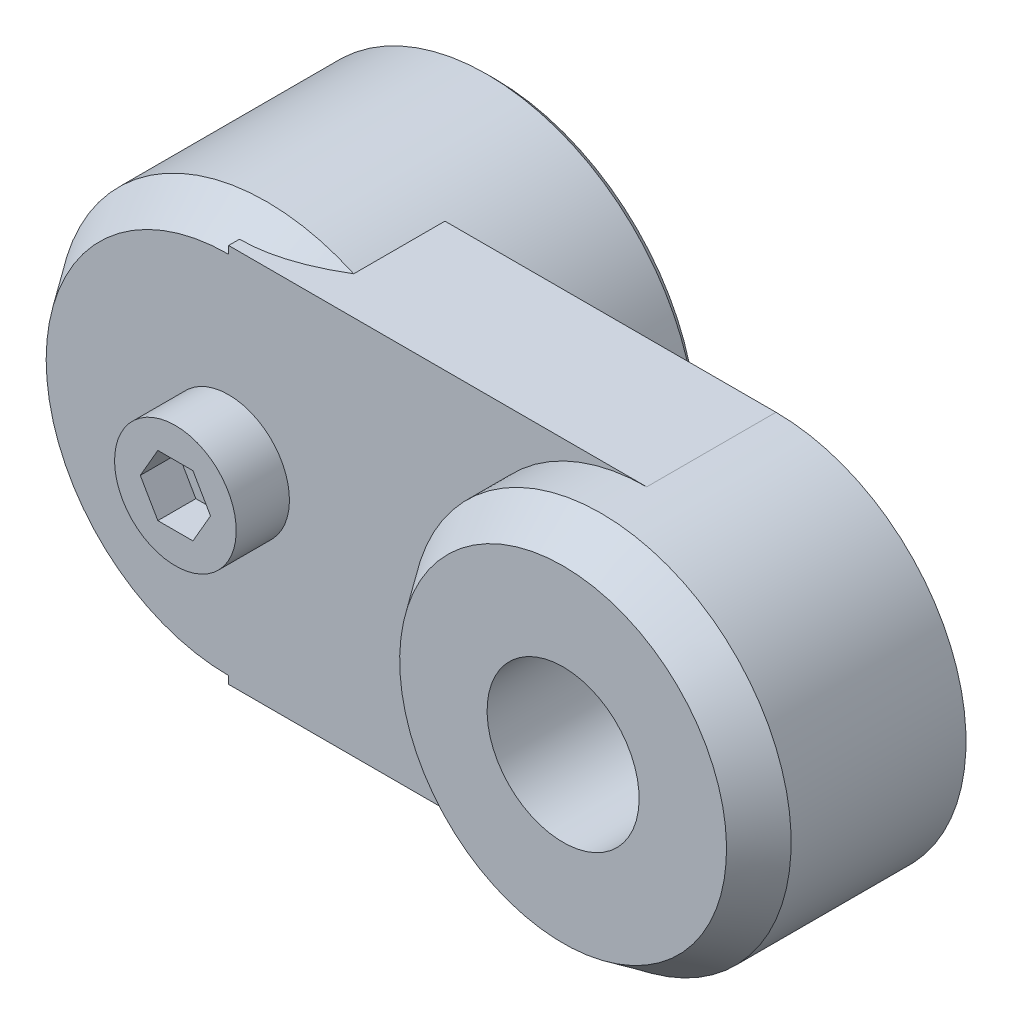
ISO-10303-21;
HEADER;
FILE_DESCRIPTION(('STEP AP214'),'2;1');
FILE_NAME('part.step','',(''),(''),'','','');
FILE_SCHEMA(('AUTOMOTIVE_DESIGN { 1 0 10303 214 1 1 1 1 }'));
ENDSEC;
DATA;
#1=APPLICATION_CONTEXT('core data for automotive mechanical design processes');
#2=APPLICATION_PROTOCOL_DEFINITION('international standard','automotive_design',2000,#1);
#3=PRODUCT_CONTEXT('',#1,'mechanical');
#4=PRODUCT('Part','Part','',(#3));
#5=PRODUCT_RELATED_PRODUCT_CATEGORY('part','',(#4));
#6=PRODUCT_DEFINITION_FORMATION('','',#4);
#7=PRODUCT_DEFINITION_CONTEXT('part definition',#1,'design');
#8=PRODUCT_DEFINITION('design','',#6,#7);
#9=PRODUCT_DEFINITION_SHAPE('','',#8);
#10=(LENGTH_UNIT() NAMED_UNIT(*) SI_UNIT(.MILLI.,.METRE.));
#11=(NAMED_UNIT(*) PLANE_ANGLE_UNIT() SI_UNIT($,.RADIAN.));
#12=(NAMED_UNIT(*) SI_UNIT($,.STERADIAN.) SOLID_ANGLE_UNIT());
#13=UNCERTAINTY_MEASURE_WITH_UNIT(LENGTH_MEASURE(1.E-05),#10,'distance_accuracy_value','');
#14=(GEOMETRIC_REPRESENTATION_CONTEXT(3) GLOBAL_UNCERTAINTY_ASSIGNED_CONTEXT((#13)) GLOBAL_UNIT_ASSIGNED_CONTEXT((#10,
#11,#12)) REPRESENTATION_CONTEXT('',''));
#15=CARTESIAN_POINT('',(0.,0.,0.));
#16=DIRECTION('',(0.,0.,1.));
#17=DIRECTION('',(1.,0.,0.));
#18=AXIS2_PLACEMENT_3D('',#15,#16,#17);
#19=CARTESIAN_POINT('',(0.,0.,35.));
#20=DIRECTION('',(0.,0.,1.));
#21=DIRECTION('',(0.,1.,0.));
#22=AXIS2_PLACEMENT_3D('',#19,#20,#21);
#23=PLANE('',#22);
#24=DIRECTION('',(-1.,0.,0.));
#25=VECTOR('',#24,1.);
#26=CARTESIAN_POINT('',(225.,-25.,35.));
#27=LINE('',#26,#25);
#28=CARTESIAN_POINT('',(55.,-25.,35.));
#29=VERTEX_POINT('',#28);
#30=CARTESIAN_POINT('',(0.,-25.,35.));
#31=VERTEX_POINT('',#30);
#32=EDGE_CURVE('E197',#29,#31,#27,.T.);
#33=ORIENTED_EDGE('',*,*,#32,.F.);
#34=CARTESIAN_POINT('',(55.,0.,35.));
#35=DIRECTION('',(0.,0.,1.));
#36=DIRECTION('',(0.,1.,0.));
#37=AXIS2_PLACEMENT_3D('',#34,#35,#36);
#38=CIRCLE('',#37,25.);
#39=CARTESIAN_POINT('',(55.,25.,35.));
#40=VERTEX_POINT('',#39);
#41=EDGE_CURVE('E177',#40,#29,#38,.T.);
#42=ORIENTED_EDGE('',*,*,#41,.F.);
#43=DIRECTION('',(-1.,0.,0.));
#44=VECTOR('',#43,1.);
#45=CARTESIAN_POINT('',(225.,25.,35.));
#46=LINE('',#45,#44);
#47=CARTESIAN_POINT('',(0.,25.,35.));
#48=VERTEX_POINT('',#47);
#49=EDGE_CURVE('E199',#40,#48,#46,.T.);
#50=ORIENTED_EDGE('',*,*,#49,.T.);
#51=DIRECTION('',(0.,1.,0.));
#52=VECTOR('',#51,1.);
#53=CARTESIAN_POINT('',(0.,-25.,35.));
#54=LINE('',#53,#52);
#55=CARTESIAN_POINT('',(0.,23.9989623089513,35.));
#56=VERTEX_POINT('',#55);
#57=EDGE_CURVE('E189',#56,#48,#54,.T.);
#58=ORIENTED_EDGE('',*,*,#57,.F.);
#59=CARTESIAN_POINT('',(0.,0.,35.));
#60=DIRECTION('',(0.,0.,1.));
#61=DIRECTION('',(0.,1.,0.));
#62=AXIS2_PLACEMENT_3D('',#59,#60,#61);
#63=CIRCLE('',#62,23.9989623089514);
#64=CARTESIAN_POINT('',(0.,-23.9989623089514,35.));
#65=VERTEX_POINT('',#64);
#66=EDGE_CURVE('E208',#56,#65,#63,.T.);
#67=ORIENTED_EDGE('',*,*,#66,.T.);
#68=EDGE_CURVE('E190',#31,#65,#54,.T.);
#69=ORIENTED_EDGE('',*,*,#68,.F.);
#70=EDGE_LOOP('',(#33,#42,#50,#58,#67,#69));
#71=FACE_BOUND('',#70,.T.);
#72=CARTESIAN_POINT('',(0.,0.,35.));
#73=DIRECTION('',(0.,0.,1.));
#74=DIRECTION('',(0.,1.,0.));
#75=AXIS2_PLACEMENT_3D('',#72,#73,#74);
#76=CIRCLE('',#75,8.);
#77=CARTESIAN_POINT('',(0.,8.,35.));
#78=VERTEX_POINT('',#77);
#79=EDGE_CURVE('E165',#78,#78,#76,.T.);
#80=ORIENTED_EDGE('',*,*,#79,.F.);
#81=EDGE_LOOP('',(#80));
#82=FACE_BOUND('',#81,.T.);
#83=ADVANCED_FACE('F14',(#71,#82),#23,.T.);
#84=CARTESIAN_POINT('',(225.,-25.,18.));
#85=DIRECTION('',(0.,0.,1.));
#86=DIRECTION('',(0.,1.,0.));
#87=AXIS2_PLACEMENT_3D('',#84,#85,#86);
#88=PLANE('',#87);
#89=CARTESIAN_POINT('',(55.,0.,18.));
#90=DIRECTION('',(0.,0.,1.));
#91=DIRECTION('',(0.,1.,0.));
#92=AXIS2_PLACEMENT_3D('',#89,#90,#91);
#93=CIRCLE('',#92,10.);
#94=CARTESIAN_POINT('',(55.,10.,18.));
#95=VERTEX_POINT('',#94);
#96=EDGE_CURVE('E174',#95,#95,#93,.T.);
#97=ORIENTED_EDGE('',*,*,#96,.T.);
#98=EDGE_LOOP('',(#97));
#99=FACE_BOUND('',#98,.T.);
#100=CARTESIAN_POINT('',(55.,0.,18.));
#101=DIRECTION('',(0.,0.,1.));
#102=DIRECTION('',(0.,1.,0.));
#103=AXIS2_PLACEMENT_3D('',#100,#101,#102);
#104=CIRCLE('',#103,25.);
#105=CARTESIAN_POINT('',(55.,-25.,18.));
#106=VERTEX_POINT('',#105);
#107=CARTESIAN_POINT('',(55.,25.,18.));
#108=VERTEX_POINT('',#107);
#109=EDGE_CURVE('E184',#106,#108,#104,.T.);
#110=ORIENTED_EDGE('',*,*,#109,.F.);
#111=DIRECTION('',(-1.,0.,0.));
#112=VECTOR('',#111,1.);
#113=CARTESIAN_POINT('',(225.,-25.,18.));
#114=LINE('',#113,#112);
#115=CARTESIAN_POINT('',(11.4564392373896,-25.,18.));
#116=VERTEX_POINT('',#115);
#117=EDGE_CURVE('E195',#106,#116,#114,.T.);
#118=ORIENTED_EDGE('',*,*,#117,.T.);
#119=CARTESIAN_POINT('',(0.,0.,18.));
#120=DIRECTION('',(0.,0.,1.));
#121=DIRECTION('',(0.,1.,0.));
#122=AXIS2_PLACEMENT_3D('',#119,#120,#121);
#123=CIRCLE('',#122,27.5);
#124=CARTESIAN_POINT('',(11.4564392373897,25.,18.));
#125=VERTEX_POINT('',#124);
#126=EDGE_CURVE('E245',#116,#125,#123,.T.);
#127=ORIENTED_EDGE('',*,*,#126,.T.);
#128=DIRECTION('',(-1.,0.,0.));
#129=VECTOR('',#128,1.);
#130=CARTESIAN_POINT('',(225.,25.,18.));
#131=LINE('',#130,#129);
#132=EDGE_CURVE('E201',#108,#125,#131,.T.);
#133=ORIENTED_EDGE('',*,*,#132,.F.);
#134=EDGE_LOOP('',(#110,#118,#127,#133));
#135=FACE_BOUND('',#134,.T.);
#136=ADVANCED_FACE('F251',(#99,#135),#88,.F.);
#137=CARTESIAN_POINT('',(225.,25.,18.));
#138=DIRECTION('',(0.,-1.,0.));
#139=DIRECTION('',(0.,0.,1.));
#140=AXIS2_PLACEMENT_3D('',#137,#138,#139);
#141=PLANE('',#140);
#142=DIRECTION('',(0.,0.,1.));
#143=VECTOR('',#142,1.);
#144=CARTESIAN_POINT('',(55.,25.,-190.));
#145=LINE('',#144,#143);
#146=EDGE_CURVE('E181',#108,#40,#145,.T.);
#147=ORIENTED_EDGE('',*,*,#146,.F.);
#148=ORIENTED_EDGE('',*,*,#132,.T.);
#149=DIRECTION('',(0.,0.,-1.));
#150=VECTOR('',#149,1.);
#151=CARTESIAN_POINT('',(11.4564392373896,25.,35.));
#152=LINE('',#151,#150);
#153=CARTESIAN_POINT('',(11.4564392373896,25.,30.));
#154=VERTEX_POINT('',#153);
#155=EDGE_CURVE('E206',#125,#154,#152,.F.);
#156=ORIENTED_EDGE('',*,*,#155,.T.);
#157=CARTESIAN_POINT('',(23.5156337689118,25.,20.2574791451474));
#158=CARTESIAN_POINT('',(23.2610089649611,25.,20.5066251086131));
#159=CARTESIAN_POINT('',(23.0053157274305,25.,20.7546780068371));
#160=CARTESIAN_POINT('',(22.4916376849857,25.,21.2484095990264));
#161=CARTESIAN_POINT('',(22.2336528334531,25.,21.494088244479));
#162=CARTESIAN_POINT('',(21.4559147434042,25.,22.22738778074));
#163=CARTESIAN_POINT('',(20.9325052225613,25.,22.7111474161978));
#164=CARTESIAN_POINT('',(19.8703592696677,25.,23.6702717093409));
#165=CARTESIAN_POINT('',(19.3315334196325,25.,24.1455375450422));
#166=CARTESIAN_POINT('',(18.2410725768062,25.,25.0810986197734));
#167=CARTESIAN_POINT('',(17.6894385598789,25.,25.5413949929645));
#168=CARTESIAN_POINT('',(16.536069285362,25.,26.4724714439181));
#169=CARTESIAN_POINT('',(15.9333741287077,25.,26.9420679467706));
#170=CARTESIAN_POINT('',(14.7087965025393,25.,27.855905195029));
#171=CARTESIAN_POINT('',(14.0869108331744,25.,28.3001416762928));
#172=CARTESIAN_POINT('',(12.8233471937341,25.,29.1553203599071));
#173=CARTESIAN_POINT('',(12.1817372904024,25.,29.5663624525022));
#174=CARTESIAN_POINT('',(10.8745497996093,25.,30.3480942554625));
#175=CARTESIAN_POINT('',(10.2089835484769,25.,30.7188027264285));
#176=CARTESIAN_POINT('',(8.87691400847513,25.,31.3964503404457));
#177=CARTESIAN_POINT('',(8.21136361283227,25.,31.7052465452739));
#178=CARTESIAN_POINT('',(6.85530500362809,25.,32.2639642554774));
#179=CARTESIAN_POINT('',(6.16479209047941,25.,32.5138746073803));
#180=CARTESIAN_POINT('',(5.12030630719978,25.,32.8323618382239));
#181=CARTESIAN_POINT('',(4.77458189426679,25.,32.9283607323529));
#182=CARTESIAN_POINT('',(4.07850406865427,25.,33.101676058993));
#183=CARTESIAN_POINT('',(3.72815154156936,25.,33.178996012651));
#184=CARTESIAN_POINT('',(3.02379681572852,25.,33.3136098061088));
#185=CARTESIAN_POINT('',(2.66979659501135,25.,33.3709139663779));
#186=CARTESIAN_POINT('',(1.95902577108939,25.,33.464483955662));
#187=CARTESIAN_POINT('',(1.60225535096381,25.,33.5007511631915));
#188=CARTESIAN_POINT('',(0.940908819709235,25.,33.5477212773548));
#189=CARTESIAN_POINT('',(0.636544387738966,25.,33.5614464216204));
#190=CARTESIAN_POINT('',(0.0274690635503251,25.,33.5729969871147));
#191=CARTESIAN_POINT('',(-0.277241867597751,25.,33.5708203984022));
#192=CARTESIAN_POINT('',(-0.886299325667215,25.,33.5505875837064));
#193=CARTESIAN_POINT('',(-1.19064556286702,25.,33.5325226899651));
#194=CARTESIAN_POINT('',(-1.7979599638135,25.,33.480772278));
#195=CARTESIAN_POINT('',(-2.10092830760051,25.,33.4470888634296));
#196=CARTESIAN_POINT('',(-2.71519481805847,25.,33.3631579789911));
#197=CARTESIAN_POINT('',(-3.02642028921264,25.,33.3123797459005));
#198=CARTESIAN_POINT('',(-3.64596973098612,25.,33.1953433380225));
#199=CARTESIAN_POINT('',(-3.95429339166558,25.,33.1290835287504));
#200=CARTESIAN_POINT('',(-4.56711836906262,25.,32.9820375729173));
#201=CARTESIAN_POINT('',(-4.87162314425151,25.,32.9012657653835));
#202=CARTESIAN_POINT('',(-5.47661118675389,25.,32.7261638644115));
#203=CARTESIAN_POINT('',(-5.77709569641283,25.,32.6318380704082));
#204=CARTESIAN_POINT('',(-6.07541297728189,25.,32.5312150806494));
#205=B_SPLINE_CURVE_WITH_KNOTS('',3,(#157,#158,#159,#160,#161,#162,#163,#164,#165,#166,#167,
#168,#169,#170,#171,#172,#173,#174,#175,#176,#177,#178,#179,#180,#181,#182,#183,#184,#185,#186,
#187,#188,#189,#190,#191,#192,#193,#194,#195,#196,#197,#198,#199,#200,#201,#202,#203,#204),
.UNSPECIFIED.,.F.,.F.,(4,2,2,2,2,2,2,2,2,2,2,2,2,2,2,2,2,2,2,2,2,2,2,4),(0.,1.06871624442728,
2.13745427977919,4.27546508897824,6.43067282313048,8.58571688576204,10.8773030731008,
13.1692734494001,15.4540676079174,17.7377944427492,19.9367026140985,22.1360269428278,
23.2120150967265,24.2878002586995,25.3630299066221,26.4381890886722,27.3518103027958,
28.2655469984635,29.1797824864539,30.0938948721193,31.0395053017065,31.9852156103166,
32.9299965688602,33.8744784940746),.UNSPECIFIED.);
#206=CARTESIAN_POINT('',(0.,25.,33.5703700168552));
#207=VERTEX_POINT('',#206);
#208=EDGE_CURVE('E217',#207,#154,#205,.F.);
#209=ORIENTED_EDGE('',*,*,#208,.F.);
#210=DIRECTION('',(0.,0.,1.));
#211=VECTOR('',#210,1.);
#212=CARTESIAN_POINT('',(0.,25.,18.));
#213=LINE('',#212,#211);
#214=EDGE_CURVE('E186',#207,#48,#213,.T.);
#215=ORIENTED_EDGE('',*,*,#214,.T.);
#216=ORIENTED_EDGE('',*,*,#49,.F.);
#217=EDGE_LOOP('',(#147,#148,#156,#209,#215,#216));
#218=FACE_BOUND('',#217,.T.);
#219=ADVANCED_FACE('F228',(#218),#141,.F.);
#220=CARTESIAN_POINT('',(225.,-25.,18.));
#221=DIRECTION('',(0.,-1.,0.));
#222=DIRECTION('',(0.,0.,1.));
#223=AXIS2_PLACEMENT_3D('',#220,#221,#222);
#224=PLANE('',#223);
#225=ORIENTED_EDGE('',*,*,#117,.F.);
#226=DIRECTION('',(0.,0.,1.));
#227=VECTOR('',#226,1.);
#228=CARTESIAN_POINT('',(55.,-25.,-190.));
#229=LINE('',#228,#227);
#230=EDGE_CURVE('E37',#106,#29,#229,.T.);
#231=ORIENTED_EDGE('',*,*,#230,.T.);
#232=ORIENTED_EDGE('',*,*,#32,.T.);
#233=DIRECTION('',(0.,0.,1.));
#234=VECTOR('',#233,1.);
#235=CARTESIAN_POINT('',(0.,-25.,18.));
#236=LINE('',#235,#234);
#237=CARTESIAN_POINT('',(0.,-25.,33.5703700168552));
#238=VERTEX_POINT('',#237);
#239=EDGE_CURVE('E192',#238,#31,#236,.T.);
#240=ORIENTED_EDGE('',*,*,#239,.F.);
#241=CARTESIAN_POINT('',(23.5156337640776,-25.,20.2574791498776));
#242=CARTESIAN_POINT('',(23.261008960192,-25.,20.5066251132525));
#243=CARTESIAN_POINT('',(23.0053157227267,-25.,20.7546780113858));
#244=CARTESIAN_POINT('',(22.4916376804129,-25.,21.2484096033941));
#245=CARTESIAN_POINT('',(22.2336528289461,-25.,21.4940882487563));
#246=CARTESIAN_POINT('',(21.4559147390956,-25.,22.2273877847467));
#247=CARTESIAN_POINT('',(20.9325052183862,-25.,22.7111474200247));
#248=CARTESIAN_POINT('',(19.8703592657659,-25.,23.6702717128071));
#249=CARTESIAN_POINT('',(19.3315334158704,-25.,24.1455375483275));
#250=CARTESIAN_POINT('',(18.2410725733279,-25.,25.0810986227));
#251=CARTESIAN_POINT('',(17.6894385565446,-25.,25.5413949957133));
#252=CARTESIAN_POINT('',(16.5360692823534,-25.,26.4724714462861));
#253=CARTESIAN_POINT('',(15.9333741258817,-25.,26.9420679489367));
#254=CARTESIAN_POINT('',(14.7087965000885,-25.,27.8559051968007));
#255=CARTESIAN_POINT('',(14.086910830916,-25.,28.3001416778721));
#256=CARTESIAN_POINT('',(12.8233471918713,-25.,29.1553203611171));
#257=CARTESIAN_POINT('',(12.1817372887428,-25.,29.5663624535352));
#258=CARTESIAN_POINT('',(10.8745497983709,-25.,30.3480942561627));
#259=CARTESIAN_POINT('',(10.2089835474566,-25.,30.7188027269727));
#260=CARTESIAN_POINT('',(8.8769140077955,-25.,31.3964503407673));
#261=CARTESIAN_POINT('',(8.21136361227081,-25.,31.7052465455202));
#262=CARTESIAN_POINT('',(6.85530500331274,-25.,32.2639642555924));
#263=CARTESIAN_POINT('',(6.16479209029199,-25.,32.5138746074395));
#264=CARTESIAN_POINT('',(5.12030630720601,-25.,32.832361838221));
#265=CARTESIAN_POINT('',(4.77458189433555,-25.,32.9283607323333));
#266=CARTESIAN_POINT('',(4.07850406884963,-25.,33.1016760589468));
#267=CARTESIAN_POINT('',(3.72815154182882,-25.,33.1789960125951));
#268=CARTESIAN_POINT('',(3.02379681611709,-25.,33.3136098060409));
#269=CARTESIAN_POINT('',(2.66979659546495,-25.,33.3709139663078));
#270=CARTESIAN_POINT('',(1.95902577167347,-25.,33.4644839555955));
#271=CARTESIAN_POINT('',(1.60225535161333,-25.,33.5007511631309));
#272=CARTESIAN_POINT('',(0.940908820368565,-25.,33.5477212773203));
#273=CARTESIAN_POINT('',(0.636544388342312,-25.,33.5614464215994));
#274=CARTESIAN_POINT('',(0.0274690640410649,-25.,33.5729969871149));
#275=CARTESIAN_POINT('',(-0.277241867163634,-25.,33.5708203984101));
#276=CARTESIAN_POINT('',(-0.886299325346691,-25.,33.5505875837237));
#277=CARTESIAN_POINT('',(-1.19064556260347,-25.,33.532522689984));
#278=CARTESIAN_POINT('',(-1.79795996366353,-25.,33.4807722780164));
#279=CARTESIAN_POINT('',(-2.10092830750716,-25.,33.4470888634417));
#280=CARTESIAN_POINT('',(-2.71519481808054,-25.,33.3631579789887));
#281=CARTESIAN_POINT('',(-3.02642028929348,-25.,33.3123797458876));
#282=CARTESIAN_POINT('',(-3.6459697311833,-25.,33.1953433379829));
#283=CARTESIAN_POINT('',(-3.95429339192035,-25.,33.1290835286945));
#284=CARTESIAN_POINT('',(-4.56711836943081,-25.,32.9820375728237));
#285=CARTESIAN_POINT('',(-4.87162314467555,-25.,32.9012657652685));
#286=CARTESIAN_POINT('',(-5.47661118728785,-25.,32.7261638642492));
#287=CARTESIAN_POINT('',(-5.77709569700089,-25.,32.63183807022));
#288=CARTESIAN_POINT('',(-6.07541297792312,-25.,32.5312150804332));
#289=B_SPLINE_CURVE_WITH_KNOTS('',3,(#241,#242,#243,#244,#245,#246,#247,#248,#249,#250,#251,
#252,#253,#254,#255,#256,#257,#258,#259,#260,#261,#262,#263,#264,#265,#266,#267,#268,#269,#270,
#271,#272,#273,#274,#275,#276,#277,#278,#279,#280,#281,#282,#283,#284,#285,#286,#287,#288),
.UNSPECIFIED.,.F.,.F.,(4,2,2,2,2,2,2,2,2,2,2,2,2,2,2,2,2,2,2,2,2,2,2,4),(0.,1.06871624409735,
2.13745427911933,4.27546508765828,6.43067282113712,8.58571688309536,10.8773030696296,
13.1692734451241,15.4540676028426,17.7377944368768,19.9367026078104,22.1360269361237,
23.2120150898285,24.2878002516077,25.3630298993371,26.438189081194,27.351810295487,
28.2655469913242,29.1797824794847,30.09389486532,31.0395052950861,31.9852156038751,
32.9299965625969,33.8744784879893),.UNSPECIFIED.);
#290=CARTESIAN_POINT('',(11.4564392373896,-25.,30.));
#291=VERTEX_POINT('',#290);
#292=EDGE_CURVE('E239',#238,#291,#289,.F.);
#293=ORIENTED_EDGE('',*,*,#292,.T.);
#294=DIRECTION('',(0.,0.,-1.));
#295=VECTOR('',#294,1.);
#296=CARTESIAN_POINT('',(11.4564392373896,-25.,35.));
#297=LINE('',#296,#295);
#298=EDGE_CURVE('E203',#116,#291,#297,.F.);
#299=ORIENTED_EDGE('',*,*,#298,.F.);
#300=EDGE_LOOP('',(#225,#231,#232,#240,#293,#299));
#301=FACE_BOUND('',#300,.T.);
#302=ADVANCED_FACE('F247',(#301),#224,.T.);
#303=CARTESIAN_POINT('',(0.,0.,35.));
#304=DIRECTION('',(0.,0.,-1.));
#305=DIRECTION('',(0.,-1.,0.));
#306=AXIS2_PLACEMENT_3D('',#303,#304,#305);
#307=CYLINDRICAL_SURFACE('',#306,27.5);
#308=CARTESIAN_POINT('',(0.,0.,1.00000000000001));
#309=DIRECTION('',(0.,0.,1.));
#310=DIRECTION('',(0.,1.,0.));
#311=AXIS2_PLACEMENT_3D('',#308,#309,#310);
#312=CIRCLE('',#311,27.5);
#313=CARTESIAN_POINT('',(0.,27.5,1.00000000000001));
#314=VERTEX_POINT('',#313);
#315=EDGE_CURVE('E22',#314,#314,#312,.T.);
#316=ORIENTED_EDGE('',*,*,#315,.T.);
#317=EDGE_LOOP('',(#316));
#318=FACE_BOUND('',#317,.T.);
#319=ORIENTED_EDGE('',*,*,#155,.F.);
#320=ORIENTED_EDGE('',*,*,#126,.F.);
#321=ORIENTED_EDGE('',*,*,#298,.T.);
#322=CARTESIAN_POINT('',(0.,0.,30.));
#323=DIRECTION('',(0.,0.,1.));
#324=DIRECTION('',(0.,1.,0.));
#325=AXIS2_PLACEMENT_3D('',#322,#323,#324);
#326=CIRCLE('',#325,27.5);
#327=EDGE_CURVE('E211',#291,#154,#326,.F.);
#328=ORIENTED_EDGE('',*,*,#327,.T.);
#329=EDGE_LOOP('',(#319,#320,#321,#328));
#330=FACE_BOUND('',#329,.T.);
#331=ADVANCED_FACE('F16',(#318,#330),#307,.T.);
#332=CARTESIAN_POINT('',(0.,0.,0.));
#333=DIRECTION('',(0.,0.,1.));
#334=DIRECTION('',(0.,1.,0.));
#335=AXIS2_PLACEMENT_3D('',#332,#333,#334);
#336=PLANE('',#335);
#337=CARTESIAN_POINT('',(0.,0.,0.));
#338=DIRECTION('',(0.,0.,1.));
#339=DIRECTION('',(0.,1.,0.));
#340=AXIS2_PLACEMENT_3D('',#337,#338,#339);
#341=CIRCLE('',#340,26.5);
#342=CARTESIAN_POINT('',(0.,26.5,0.));
#343=VERTEX_POINT('',#342);
#344=EDGE_CURVE('E9',#343,#343,#341,.F.);
#345=ORIENTED_EDGE('',*,*,#344,.T.);
#346=EDGE_LOOP('',(#345));
#347=FACE_BOUND('',#346,.T.);
#348=ADVANCED_FACE('F236',(#347),#336,.F.);
#349=CARTESIAN_POINT('',(0.,0.,35.));
#350=DIRECTION('',(0.,0.,-1.));
#351=DIRECTION('',(0.,-1.,0.));
#352=AXIS2_PLACEMENT_3D('',#349,#350,#351);
#353=CONICAL_SURFACE('',#352,23.9989623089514,0.610865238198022);
#354=ORIENTED_EDGE('',*,*,#292,.F.);
#355=DIRECTION('',(0.,-0.573576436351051,-0.819152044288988));
#356=VECTOR('',#355,1.);
#357=CARTESIAN_POINT('',(0.,0.,69.2740701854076));
#358=LINE('',#357,#356);
#359=EDGE_CURVE('E226',#238,#65,#358,.F.);
#360=ORIENTED_EDGE('',*,*,#359,.T.);
#361=ORIENTED_EDGE('',*,*,#66,.F.);
#362=DIRECTION('',(0.,-0.573576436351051,0.819152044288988));
#363=VECTOR('',#362,1.);
#364=CARTESIAN_POINT('',(0.,0.,69.2740701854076));
#365=LINE('',#364,#363);
#366=EDGE_CURVE('E214',#56,#207,#365,.F.);
#367=ORIENTED_EDGE('',*,*,#366,.T.);
#368=ORIENTED_EDGE('',*,*,#208,.T.);
#369=ORIENTED_EDGE('',*,*,#327,.F.);
#370=EDGE_LOOP('',(#354,#360,#361,#367,#368,#369));
#371=FACE_BOUND('',#370,.T.);
#372=ADVANCED_FACE('F231',(#371),#353,.T.);
#373=CARTESIAN_POINT('',(0.,25.,18.));
#374=DIRECTION('',(1.,0.,0.));
#375=DIRECTION('',(0.,0.,-1.));
#376=AXIS2_PLACEMENT_3D('',#373,#374,#375);
#377=PLANE('',#376);
#378=ORIENTED_EDGE('',*,*,#359,.F.);
#379=ORIENTED_EDGE('',*,*,#239,.T.);
#380=ORIENTED_EDGE('',*,*,#68,.T.);
#381=EDGE_LOOP('',(#378,#379,#380));
#382=FACE_BOUND('',#381,.T.);
#383=ADVANCED_FACE('F235',(#382),#377,.F.);
#384=ORIENTED_EDGE('',*,*,#366,.F.);
#385=ORIENTED_EDGE('',*,*,#57,.T.);
#386=ORIENTED_EDGE('',*,*,#214,.F.);
#387=EDGE_LOOP('',(#384,#385,#386));
#388=FACE_BOUND('',#387,.T.);
#389=ADVANCED_FACE('F255',(#388),#377,.F.);
#390=CARTESIAN_POINT('',(55.,0.,-190.));
#391=DIRECTION('',(0.,0.,1.));
#392=DIRECTION('',(0.,1.,0.));
#393=AXIS2_PLACEMENT_3D('',#390,#391,#392);
#394=CYLINDRICAL_SURFACE('',#393,25.);
#395=CARTESIAN_POINT('',(55.,0.,41.));
#396=DIRECTION('',(0.,0.,1.));
#397=DIRECTION('',(0.,1.,0.));
#398=AXIS2_PLACEMENT_3D('',#395,#396,#397);
#399=CIRCLE('',#398,25.);
#400=CARTESIAN_POINT('',(55.,25.,41.));
#401=VERTEX_POINT('',#400);
#402=EDGE_CURVE('E491',#401,#401,#399,.F.);
#403=ORIENTED_EDGE('',*,*,#402,.T.);
#404=EDGE_LOOP('',(#403));
#405=FACE_BOUND('',#404,.T.);
#406=ORIENTED_EDGE('',*,*,#109,.T.);
#407=ORIENTED_EDGE('',*,*,#146,.T.);
#408=ORIENTED_EDGE('',*,*,#41,.T.);
#409=ORIENTED_EDGE('',*,*,#230,.F.);
#410=EDGE_LOOP('',(#406,#407,#408,#409));
#411=FACE_BOUND('',#410,.T.);
#412=ADVANCED_FACE('F258',(#405,#411),#394,.T.);
#413=CARTESIAN_POINT('',(55.,0.,46.));
#414=DIRECTION('',(0.,0.,1.));
#415=DIRECTION('',(0.,1.,0.));
#416=AXIS2_PLACEMENT_3D('',#413,#414,#415);
#417=PLANE('',#416);
#418=CARTESIAN_POINT('',(55.,0.,46.));
#419=DIRECTION('',(0.,0.,1.));
#420=DIRECTION('',(0.,1.,0.));
#421=AXIS2_PLACEMENT_3D('',#418,#419,#420);
#422=CIRCLE('',#421,10.);
#423=CARTESIAN_POINT('',(55.,10.,46.));
#424=VERTEX_POINT('',#423);
#425=EDGE_CURVE('E171',#424,#424,#422,.T.);
#426=ORIENTED_EDGE('',*,*,#425,.F.);
#427=EDGE_LOOP('',(#426));
#428=FACE_BOUND('',#427,.T.);
#429=CARTESIAN_POINT('',(55.,0.,46.));
#430=DIRECTION('',(0.,0.,1.));
#431=DIRECTION('',(0.,1.,0.));
#432=AXIS2_PLACEMENT_3D('',#429,#430,#431);
#433=CIRCLE('',#432,21.4989623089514);
#434=CARTESIAN_POINT('',(55.,21.4989623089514,46.));
#435=VERTEX_POINT('',#434);
#436=EDGE_CURVE('E335',#435,#435,#433,.T.);
#437=ORIENTED_EDGE('',*,*,#436,.T.);
#438=EDGE_LOOP('',(#437));
#439=FACE_BOUND('',#438,.T.);
#440=ADVANCED_FACE('F262',(#428,#439),#417,.T.);
#441=CARTESIAN_POINT('',(55.,0.,46.));
#442=DIRECTION('',(0.,0.,-1.));
#443=DIRECTION('',(0.,-1.,0.));
#444=AXIS2_PLACEMENT_3D('',#441,#442,#443);
#445=CONICAL_SURFACE('',#444,21.4989623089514,0.610865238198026);
#446=ORIENTED_EDGE('',*,*,#402,.F.);
#447=EDGE_LOOP('',(#446));
#448=FACE_BOUND('',#447,.T.);
#449=ORIENTED_EDGE('',*,*,#436,.F.);
#450=EDGE_LOOP('',(#449));
#451=FACE_BOUND('',#450,.T.);
#452=ADVANCED_FACE('F266',(#448,#451),#445,.T.);
#453=CARTESIAN_POINT('',(55.,0.,0.));
#454=DIRECTION('',(0.,0.,1.));
#455=DIRECTION('',(0.,1.,0.));
#456=AXIS2_PLACEMENT_3D('',#453,#454,#455);
#457=CYLINDRICAL_SURFACE('',#456,10.);
#458=ORIENTED_EDGE('',*,*,#425,.T.);
#459=EDGE_LOOP('',(#458));
#460=FACE_BOUND('',#459,.T.);
#461=ORIENTED_EDGE('',*,*,#96,.F.);
#462=EDGE_LOOP('',(#461));
#463=FACE_BOUND('',#462,.T.);
#464=ADVANCED_FACE('F270',(#460,#463),#457,.F.);
#465=CARTESIAN_POINT('',(0.,0.,42.));
#466=DIRECTION('',(0.,0.,-1.));
#467=DIRECTION('',(0.,-1.,0.));
#468=AXIS2_PLACEMENT_3D('',#465,#466,#467);
#469=CYLINDRICAL_SURFACE('',#468,8.);
#470=CARTESIAN_POINT('',(0.,0.,42.));
#471=DIRECTION('',(0.,0.,1.));
#472=DIRECTION('',(0.,1.,0.));
#473=AXIS2_PLACEMENT_3D('',#470,#471,#472);
#474=CIRCLE('',#473,8.);
#475=CARTESIAN_POINT('',(0.,8.,42.));
#476=VERTEX_POINT('',#475);
#477=EDGE_CURVE('E168',#476,#476,#474,.T.);
#478=ORIENTED_EDGE('',*,*,#477,.F.);
#479=EDGE_LOOP('',(#478));
#480=FACE_BOUND('',#479,.T.);
#481=ORIENTED_EDGE('',*,*,#79,.T.);
#482=EDGE_LOOP('',(#481));
#483=FACE_BOUND('',#482,.T.);
#484=ADVANCED_FACE('F274',(#480,#483),#469,.T.);
#485=CARTESIAN_POINT('',(0.,0.,42.));
#486=DIRECTION('',(0.,0.,1.));
#487=DIRECTION('',(0.,1.,0.));
#488=AXIS2_PLACEMENT_3D('',#485,#486,#487);
#489=PLANE('',#488);
#490=DIRECTION('',(-0.5,-0.866025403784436,0.));
#491=VECTOR('',#490,1.);
#492=CARTESIAN_POINT('',(-2.30940107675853,4.,42.));
#493=LINE('',#492,#491);
#494=CARTESIAN_POINT('',(-2.30940107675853,4.,42.));
#495=VERTEX_POINT('',#494);
#496=CARTESIAN_POINT('',(-4.61880215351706,0.,42.));
#497=VERTEX_POINT('',#496);
#498=EDGE_CURVE('E29',#495,#497,#493,.T.);
#499=ORIENTED_EDGE('',*,*,#498,.F.);
#500=DIRECTION('',(1.,0.,0.));
#501=VECTOR('',#500,1.);
#502=CARTESIAN_POINT('',(-2.30940107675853,4.,42.));
#503=LINE('',#502,#501);
#504=CARTESIAN_POINT('',(2.30940107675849,4.,42.));
#505=VERTEX_POINT('',#504);
#506=EDGE_CURVE('E139',#495,#505,#503,.T.);
#507=ORIENTED_EDGE('',*,*,#506,.T.);
#508=DIRECTION('',(0.5,-0.86602540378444,0.));
#509=VECTOR('',#508,1.);
#510=CARTESIAN_POINT('',(2.30940107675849,4.,42.));
#511=LINE('',#510,#509);
#512=CARTESIAN_POINT('',(4.61880215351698,0.,42.));
#513=VERTEX_POINT('',#512);
#514=EDGE_CURVE('E134',#505,#513,#511,.T.);
#515=ORIENTED_EDGE('',*,*,#514,.T.);
#516=DIRECTION('',(0.5,0.86602540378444,0.));
#517=VECTOR('',#516,1.);
#518=CARTESIAN_POINT('',(2.30940107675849,-4.,42.));
#519=LINE('',#518,#517);
#520=CARTESIAN_POINT('',(2.30940107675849,-4.,42.));
#521=VERTEX_POINT('',#520);
#522=EDGE_CURVE('E132',#521,#513,#519,.T.);
#523=ORIENTED_EDGE('',*,*,#522,.F.);
#524=DIRECTION('',(1.,0.,0.));
#525=VECTOR('',#524,1.);
#526=CARTESIAN_POINT('',(-2.30940107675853,-4.,42.));
#527=LINE('',#526,#525);
#528=CARTESIAN_POINT('',(-2.30940107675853,-4.,42.));
#529=VERTEX_POINT('',#528);
#530=EDGE_CURVE('E113',#529,#521,#527,.T.);
#531=ORIENTED_EDGE('',*,*,#530,.F.);
#532=DIRECTION('',(-0.5,0.866025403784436,0.));
#533=VECTOR('',#532,1.);
#534=CARTESIAN_POINT('',(-2.30940107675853,-4.,42.));
#535=LINE('',#534,#533);
#536=EDGE_CURVE('E124',#529,#497,#535,.T.);
#537=ORIENTED_EDGE('',*,*,#536,.T.);
#538=EDGE_LOOP('',(#499,#507,#515,#523,#531,#537));
#539=FACE_BOUND('',#538,.T.);
#540=ORIENTED_EDGE('',*,*,#477,.T.);
#541=EDGE_LOOP('',(#540));
#542=FACE_BOUND('',#541,.T.);
#543=ADVANCED_FACE('F128',(#539,#542),#489,.T.);
#544=CARTESIAN_POINT('',(-2.30940107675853,4.,37.));
#545=DIRECTION('',(-0.866025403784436,0.5,0.));
#546=DIRECTION('',(-0.5,-0.866025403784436,0.));
#547=AXIS2_PLACEMENT_3D('',#544,#545,#546);
#548=PLANE('',#547);
#549=DIRECTION('',(0.,0.,1.));
#550=VECTOR('',#549,1.);
#551=CARTESIAN_POINT('',(-2.30940107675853,4.,37.));
#552=LINE('',#551,#550);
#553=CARTESIAN_POINT('',(-2.30940107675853,4.,37.));
#554=VERTEX_POINT('',#553);
#555=EDGE_CURVE('E163',#554,#495,#552,.T.);
#556=ORIENTED_EDGE('',*,*,#555,.T.);
#557=ORIENTED_EDGE('',*,*,#498,.T.);
#558=DIRECTION('',(0.,0.,1.));
#559=VECTOR('',#558,1.);
#560=CARTESIAN_POINT('',(-4.61880215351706,0.,37.));
#561=LINE('',#560,#559);
#562=CARTESIAN_POINT('',(-4.61880215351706,0.,37.));
#563=VERTEX_POINT('',#562);
#564=EDGE_CURVE('E121',#563,#497,#561,.T.);
#565=ORIENTED_EDGE('',*,*,#564,.F.);
#566=DIRECTION('',(-0.5,-0.866025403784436,0.));
#567=VECTOR('',#566,1.);
#568=CARTESIAN_POINT('',(-2.30940107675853,4.,37.));
#569=LINE('',#568,#567);
#570=EDGE_CURVE('E142',#554,#563,#569,.T.);
#571=ORIENTED_EDGE('',*,*,#570,.F.);
#572=EDGE_LOOP('',(#556,#557,#565,#571));
#573=FACE_BOUND('',#572,.T.);
#574=ADVANCED_FACE('F279',(#573),#548,.F.);
#575=CARTESIAN_POINT('',(-2.30940107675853,4.,37.));
#576=DIRECTION('',(0.,-1.,0.));
#577=DIRECTION('',(1.,0.,0.));
#578=AXIS2_PLACEMENT_3D('',#575,#576,#577);
#579=PLANE('',#578);
#580=DIRECTION('',(0.,0.,1.));
#581=VECTOR('',#580,1.);
#582=CARTESIAN_POINT('',(2.30940107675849,4.,37.));
#583=LINE('',#582,#581);
#584=CARTESIAN_POINT('',(2.30940107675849,4.,37.));
#585=VERTEX_POINT('',#584);
#586=EDGE_CURVE('E161',#585,#505,#583,.T.);
#587=ORIENTED_EDGE('',*,*,#586,.T.);
#588=ORIENTED_EDGE('',*,*,#506,.F.);
#589=ORIENTED_EDGE('',*,*,#555,.F.);
#590=DIRECTION('',(1.,0.,0.));
#591=VECTOR('',#590,1.);
#592=CARTESIAN_POINT('',(-2.30940107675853,4.,37.));
#593=LINE('',#592,#591);
#594=EDGE_CURVE('E154',#554,#585,#593,.T.);
#595=ORIENTED_EDGE('',*,*,#594,.T.);
#596=EDGE_LOOP('',(#587,#588,#589,#595));
#597=FACE_BOUND('',#596,.T.);
#598=ADVANCED_FACE('F282',(#597),#579,.T.);
#599=CARTESIAN_POINT('',(2.30940107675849,4.,37.));
#600=DIRECTION('',(-0.86602540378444,-0.5,0.));
#601=DIRECTION('',(0.5,-0.86602540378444,0.));
#602=AXIS2_PLACEMENT_3D('',#599,#600,#601);
#603=PLANE('',#602);
#604=DIRECTION('',(0.,0.,1.));
#605=VECTOR('',#604,1.);
#606=CARTESIAN_POINT('',(4.61880215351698,0.,37.));
#607=LINE('',#606,#605);
#608=CARTESIAN_POINT('',(4.61880215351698,0.,37.));
#609=VERTEX_POINT('',#608);
#610=EDGE_CURVE('E159',#609,#513,#607,.T.);
#611=ORIENTED_EDGE('',*,*,#610,.T.);
#612=ORIENTED_EDGE('',*,*,#514,.F.);
#613=ORIENTED_EDGE('',*,*,#586,.F.);
#614=DIRECTION('',(0.5,-0.86602540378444,0.));
#615=VECTOR('',#614,1.);
#616=CARTESIAN_POINT('',(2.30940107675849,4.,37.));
#617=LINE('',#616,#615);
#618=EDGE_CURVE('E151',#585,#609,#617,.T.);
#619=ORIENTED_EDGE('',*,*,#618,.T.);
#620=EDGE_LOOP('',(#611,#612,#613,#619));
#621=FACE_BOUND('',#620,.T.);
#622=ADVANCED_FACE('F285',(#621),#603,.T.);
#623=CARTESIAN_POINT('',(2.30940107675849,-4.,37.));
#624=DIRECTION('',(0.86602540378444,-0.5,0.));
#625=DIRECTION('',(0.5,0.86602540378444,0.));
#626=AXIS2_PLACEMENT_3D('',#623,#624,#625);
#627=PLANE('',#626);
#628=DIRECTION('',(0.,0.,1.));
#629=VECTOR('',#628,1.);
#630=CARTESIAN_POINT('',(2.30940107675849,-4.,37.));
#631=LINE('',#630,#629);
#632=CARTESIAN_POINT('',(2.30940107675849,-4.,37.));
#633=VERTEX_POINT('',#632);
#634=EDGE_CURVE('E120',#633,#521,#631,.T.);
#635=ORIENTED_EDGE('',*,*,#634,.T.);
#636=ORIENTED_EDGE('',*,*,#522,.T.);
#637=ORIENTED_EDGE('',*,*,#610,.F.);
#638=DIRECTION('',(0.5,0.86602540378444,0.));
#639=VECTOR('',#638,1.);
#640=CARTESIAN_POINT('',(2.30940107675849,-4.,37.));
#641=LINE('',#640,#639);
#642=EDGE_CURVE('E148',#633,#609,#641,.T.);
#643=ORIENTED_EDGE('',*,*,#642,.F.);
#644=EDGE_LOOP('',(#635,#636,#637,#643));
#645=FACE_BOUND('',#644,.T.);
#646=ADVANCED_FACE('F289',(#645),#627,.F.);
#647=CARTESIAN_POINT('',(-2.30940107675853,-4.,37.));
#648=DIRECTION('',(0.,-1.,0.));
#649=DIRECTION('',(1.,0.,0.));
#650=AXIS2_PLACEMENT_3D('',#647,#648,#649);
#651=PLANE('',#650);
#652=DIRECTION('',(0.,0.,1.));
#653=VECTOR('',#652,1.);
#654=CARTESIAN_POINT('',(-2.30940107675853,-4.,37.));
#655=LINE('',#654,#653);
#656=CARTESIAN_POINT('',(-2.30940107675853,-4.,37.));
#657=VERTEX_POINT('',#656);
#658=EDGE_CURVE('E109',#657,#529,#655,.T.);
#659=ORIENTED_EDGE('',*,*,#658,.T.);
#660=ORIENTED_EDGE('',*,*,#530,.T.);
#661=ORIENTED_EDGE('',*,*,#634,.F.);
#662=DIRECTION('',(1.,0.,0.));
#663=VECTOR('',#662,1.);
#664=CARTESIAN_POINT('',(-2.30940107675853,-4.,37.));
#665=LINE('',#664,#663);
#666=EDGE_CURVE('E116',#657,#633,#665,.T.);
#667=ORIENTED_EDGE('',*,*,#666,.F.);
#668=EDGE_LOOP('',(#659,#660,#661,#667));
#669=FACE_BOUND('',#668,.T.);
#670=ADVANCED_FACE('F111',(#669),#651,.F.);
#671=CARTESIAN_POINT('',(-2.30940107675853,-4.,37.));
#672=DIRECTION('',(0.866025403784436,0.5,0.));
#673=DIRECTION('',(-0.5,0.866025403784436,0.));
#674=AXIS2_PLACEMENT_3D('',#671,#672,#673);
#675=PLANE('',#674);
#676=DIRECTION('',(-0.5,0.866025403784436,0.));
#677=VECTOR('',#676,1.);
#678=CARTESIAN_POINT('',(-2.30940107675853,-4.,37.));
#679=LINE('',#678,#677);
#680=EDGE_CURVE('E145',#657,#563,#679,.T.);
#681=ORIENTED_EDGE('',*,*,#680,.T.);
#682=ORIENTED_EDGE('',*,*,#564,.T.);
#683=ORIENTED_EDGE('',*,*,#536,.F.);
#684=ORIENTED_EDGE('',*,*,#658,.F.);
#685=EDGE_LOOP('',(#681,#682,#683,#684));
#686=FACE_BOUND('',#685,.T.);
#687=ADVANCED_FACE('F125',(#686),#675,.T.);
#688=CARTESIAN_POINT('',(-4.61880215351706,0.,37.));
#689=DIRECTION('',(0.,0.,-1.));
#690=DIRECTION('',(0.,-1.,0.));
#691=AXIS2_PLACEMENT_3D('',#688,#689,#690);
#692=PLANE('',#691);
#693=ORIENTED_EDGE('',*,*,#570,.T.);
#694=ORIENTED_EDGE('',*,*,#680,.F.);
#695=ORIENTED_EDGE('',*,*,#666,.T.);
#696=ORIENTED_EDGE('',*,*,#642,.T.);
#697=ORIENTED_EDGE('',*,*,#618,.F.);
#698=ORIENTED_EDGE('',*,*,#594,.F.);
#699=EDGE_LOOP('',(#693,#694,#695,#696,#697,#698));
#700=FACE_BOUND('',#699,.T.);
#701=ADVANCED_FACE('F296',(#700),#692,.F.);
#702=CARTESIAN_POINT('',(0.,0.,1.00000000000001));
#703=DIRECTION('',(0.,0.,1.));
#704=DIRECTION('',(0.,1.,0.));
#705=AXIS2_PLACEMENT_3D('',#702,#703,#704);
#706=CONICAL_SURFACE('',#705,27.5,0.785398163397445);
#707=ORIENTED_EDGE('',*,*,#344,.F.);
#708=EDGE_LOOP('',(#707));
#709=FACE_BOUND('',#708,.T.);
#710=ORIENTED_EDGE('',*,*,#315,.F.);
#711=EDGE_LOOP('',(#710));
#712=FACE_BOUND('',#711,.T.);
#713=ADVANCED_FACE('F299',(#709,#712),#706,.T.);
#714=CLOSED_SHELL('',(#83,#136,#219,#302,#331,#348,#372,#383,#389,#412,#440,#452,#464,#484,#543,
#574,#598,#622,#646,#670,#687,#701,#713));
#715=MANIFOLD_SOLID_BREP('B1',#714);
#716=ADVANCED_BREP_SHAPE_REPRESENTATION('',(#18,#715),#14);
#717=SHAPE_DEFINITION_REPRESENTATION(#9,#716);
ENDSEC;
END-ISO-10303-21;
